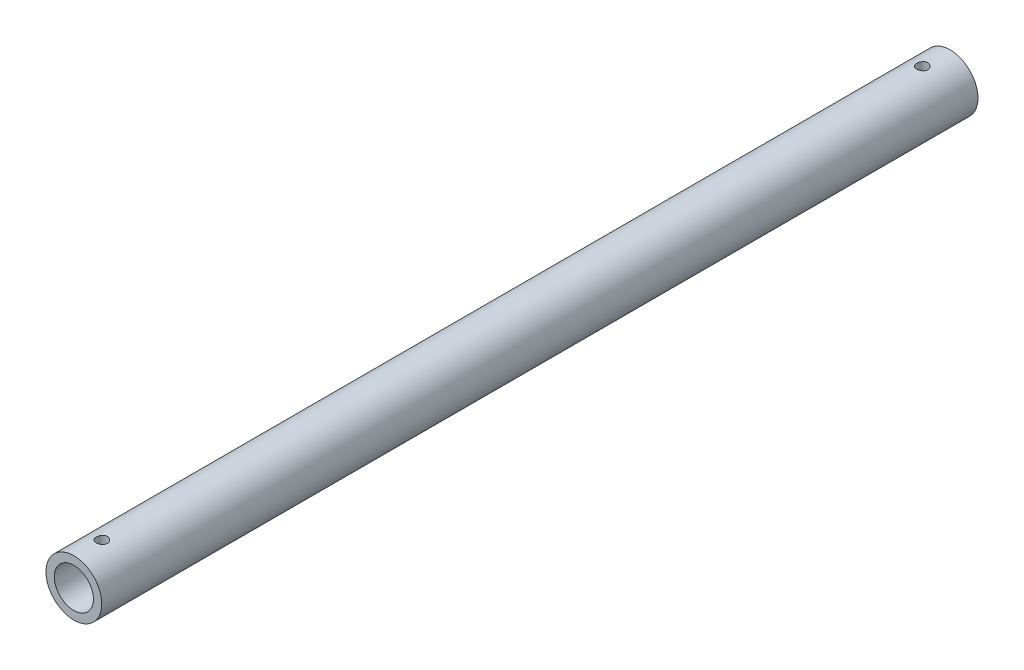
from build123d import *

# Parameters (mm, degrees)
ESQUISSE1_R                  = 5
ESQUISSE1_R_2                = 3.505
BOSS_EXTRU_1_DEPTH           = 157
ENL_V_MAT_EXTRU_1_DEPTH      = 10
ENL_V_MAT_EXTRU_1_DEPTH_BACK = 10
ESQUISSE2_R                  = 1


with BuildPart() as part:
    # Esquisse1 → Boss.-Extru.1 (new body)
    with BuildSketch(Plane.XY):
        Circle(ESQUISSE1_R)
        Circle(ESQUISSE1_R_2, mode=Mode.SUBTRACT)
    extrude(amount=BOSS_EXTRU_1_DEPTH)

    # Esquisse2 → Enl_v. mat.-Extru.1 (cut, two sides: drawn at the far end of the back side and taken through both)
    with BuildSketch(Plane(origin=(0, 0, 0), x_dir=(1, 0, 0), z_dir=(0, 1, 0)).offset(-ENL_V_MAT_EXTRU_1_DEPTH_BACK)):
        with Locations(Location((0, -152, 0), (0, 0, 90))):
            Circle(ESQUISSE2_R)
        with Locations(Location((0, -5, 0), (0, 0, 90))):
            Circle(ESQUISSE2_R)
    extrude(amount=ENL_V_MAT_EXTRU_1_DEPTH + ENL_V_MAT_EXTRU_1_DEPTH_BACK, mode=Mode.SUBTRACT)


solid = part.part
